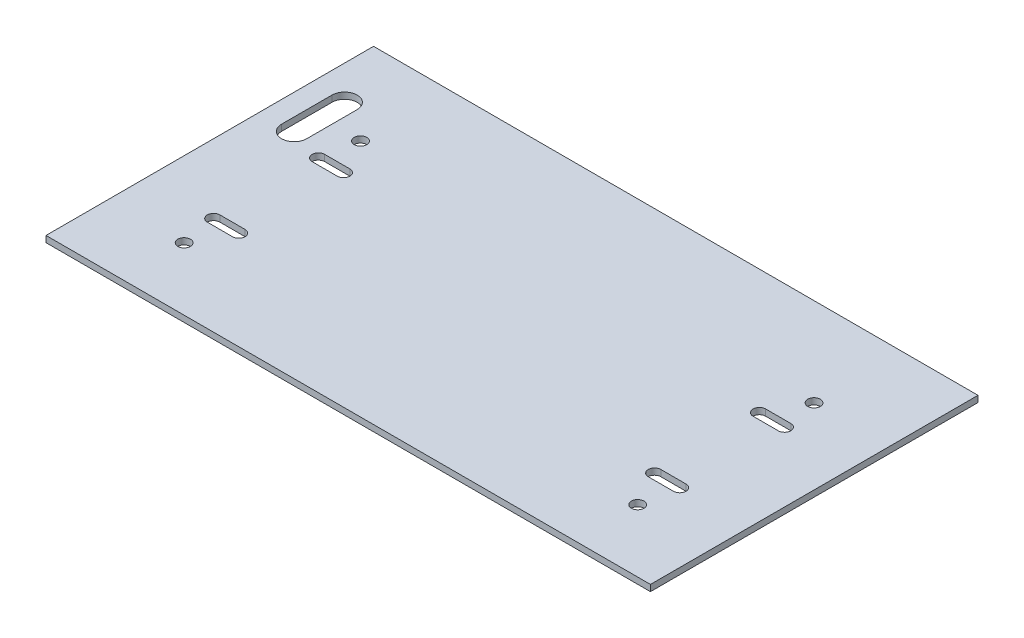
from build123d import *

# Parameters (mm, degrees)
SKETCH1_W           = 304.6625
SKETCH1_H           = 165.1
SKETCH1_R           = 3.175
BOSS_EXTRUDE1_DEPTH = 3.175
CUT_EXTRUDE1_DEPTH  = 1553.380144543
CUT_EXTRUDE2_DEPTH  = 1553.380144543


with BuildPart() as part:
    # Sketch1 → Boss-Extrude1 (new body)
    with BuildSketch(Plane(origin=(0, 402.212122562, 0), x_dir=(1, 0, 0), z_dir=(0, 1, 0))):
        with Locations((-759.871620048, -1173.539151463)):
            Rectangle(SKETCH1_W, SKETCH1_H)
        with Locations(Location((-874.171620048, -1135.603252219, 0), (0, 0, 270))):
            Circle(SKETCH1_R, mode=Mode.SUBTRACT)
        with Locations(Location((-645.571620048, -1135.603252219, 0), (0, 0, 270))):
            Circle(SKETCH1_R, mode=Mode.SUBTRACT)
        with Locations(Location((-645.571620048, -1224.503252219, 0), (0, 0, 270))):
            Circle(SKETCH1_R, mode=Mode.SUBTRACT)
        with Locations(Location((-874.171620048, -1224.503252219, 0), (0, 0, 270))):
            Circle(SKETCH1_R, mode=Mode.SUBTRACT)
    extrude(amount=BOSS_EXTRUDE1_DEPTH)

    # Sketch2 → Cut-Extrude1 (cut, through all)
    with BuildSketch(Plane(origin=(0, 405.387122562, 0), x_dir=(1, 0, 0), z_dir=(0, 1, 0))):
        with BuildLine():
            Line((-888.707870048, -1122.739151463), (-888.707870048, -1148.139151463))
            ThreePointArc((-888.707870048, -1148.139151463), (-895.057870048, -1154.489151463), (-901.407870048, -1148.139151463))
            Line((-901.407870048, -1148.139151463), (-901.407870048, -1122.739151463))
            ThreePointArc((-901.407870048, -1122.739151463), (-895.057870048, -1116.389151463), (-888.707870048, -1122.739151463))
        make_face()
    extrude(amount=-CUT_EXTRUDE1_DEPTH, mode=Mode.SUBTRACT)

    # Sketch3 → Cut-Extrude2 (cut, through all)
    with BuildSketch(Plane(origin=(0, 405.387122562, 0), x_dir=(1, 0, 0), z_dir=(0, 1, 0))):
        with BuildLine():
            Line((-877.346620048, -1150.461909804), (-864.646620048, -1150.461909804))
            ThreePointArc((-864.646620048, -1150.461909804), (-861.471620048, -1153.636909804), (-864.646620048, -1156.811909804))
            Line((-864.646620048, -1156.811909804), (-877.346620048, -1156.811909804))
            ThreePointArc((-877.346620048, -1156.811909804), (-880.521620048, -1153.636909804), (-877.346620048, -1150.461909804))
        make_face()
        with BuildLine():
            Line((-877.346620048, -1203.294594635), (-864.646620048, -1203.294594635))
            ThreePointArc((-864.646620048, -1203.294594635), (-861.471620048, -1206.469594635), (-864.646620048, -1209.644594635))
            Line((-864.646620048, -1209.644594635), (-877.346620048, -1209.644594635))
            ThreePointArc((-877.346620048, -1209.644594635), (-880.521620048, -1206.469594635), (-877.346620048, -1203.294594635))
        make_face()
        with BuildLine():
            Line((-642.396620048, -1150.461909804), (-655.096620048, -1150.461909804))
            ThreePointArc((-655.096620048, -1150.461909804), (-658.271620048, -1153.636909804), (-655.096620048, -1156.811909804))
            Line((-655.096620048, -1156.811909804), (-642.396620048, -1156.811909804))
            ThreePointArc((-642.396620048, -1156.811909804), (-639.221620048, -1153.636909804), (-642.396620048, -1150.461909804))
        make_face()
        with BuildLine():
            Line((-642.396620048, -1203.294594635), (-655.096620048, -1203.294594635))
            ThreePointArc((-655.096620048, -1203.294594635), (-658.271620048, -1206.469594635), (-655.096620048, -1209.644594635))
            Line((-655.096620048, -1209.644594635), (-642.396620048, -1209.644594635))
            ThreePointArc((-642.396620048, -1209.644594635), (-639.221620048, -1206.469594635), (-642.396620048, -1203.294594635))
        make_face()
    extrude(amount=-CUT_EXTRUDE2_DEPTH, mode=Mode.SUBTRACT)


solid = part.part
